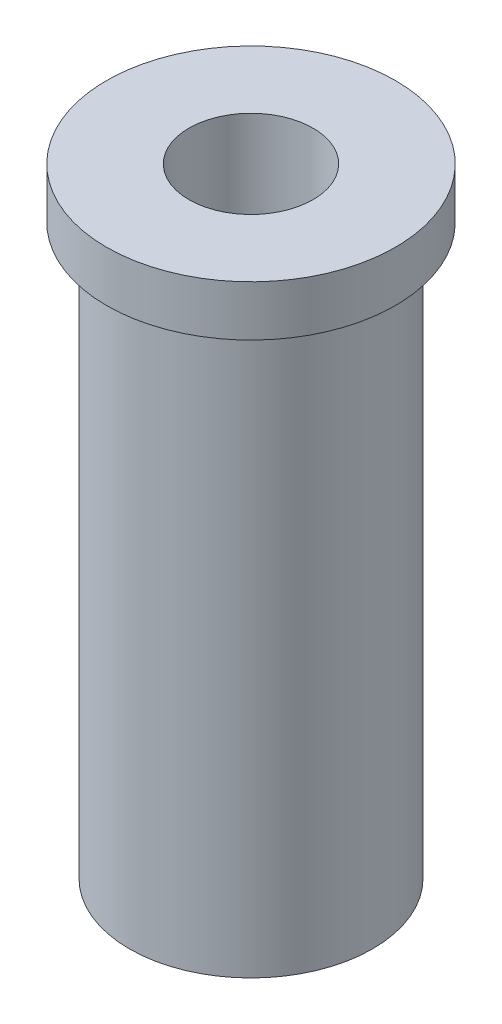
ISO-10303-21;
HEADER;
FILE_DESCRIPTION(('STEP AP214'),'2;1');
FILE_NAME('part.step','',(''),(''),'','','');
FILE_SCHEMA(('AUTOMOTIVE_DESIGN { 1 0 10303 214 1 1 1 1 }'));
ENDSEC;
DATA;
#1=APPLICATION_CONTEXT('core data for automotive mechanical design processes');
#2=APPLICATION_PROTOCOL_DEFINITION('international standard','automotive_design',2000,#1);
#3=PRODUCT_CONTEXT('',#1,'mechanical');
#4=PRODUCT('Part','Part','',(#3));
#5=PRODUCT_RELATED_PRODUCT_CATEGORY('part','',(#4));
#6=PRODUCT_DEFINITION_FORMATION('','',#4);
#7=PRODUCT_DEFINITION_CONTEXT('part definition',#1,'design');
#8=PRODUCT_DEFINITION('design','',#6,#7);
#9=PRODUCT_DEFINITION_SHAPE('','',#8);
#10=(LENGTH_UNIT() NAMED_UNIT(*) SI_UNIT(.MILLI.,.METRE.));
#11=(NAMED_UNIT(*) PLANE_ANGLE_UNIT() SI_UNIT($,.RADIAN.));
#12=(NAMED_UNIT(*) SI_UNIT($,.STERADIAN.) SOLID_ANGLE_UNIT());
#13=UNCERTAINTY_MEASURE_WITH_UNIT(LENGTH_MEASURE(1.E-05),#10,'distance_accuracy_value','');
#14=(GEOMETRIC_REPRESENTATION_CONTEXT(3) GLOBAL_UNCERTAINTY_ASSIGNED_CONTEXT((#13)) GLOBAL_UNIT_ASSIGNED_CONTEXT((#10,
#11,#12)) REPRESENTATION_CONTEXT('',''));
#15=CARTESIAN_POINT('',(0.,0.,0.));
#16=DIRECTION('',(0.,0.,1.));
#17=DIRECTION('',(1.,0.,0.));
#18=AXIS2_PLACEMENT_3D('',#15,#16,#17);
#19=CARTESIAN_POINT('',(0.,0.,0.));
#20=DIRECTION('',(0.,1.,0.));
#21=DIRECTION('',(0.,0.,1.));
#22=AXIS2_PLACEMENT_3D('',#19,#20,#21);
#23=CYLINDRICAL_SURFACE('',#22,4.75);
#24=CARTESIAN_POINT('',(0.,0.,0.));
#25=DIRECTION('',(0.,1.,0.));
#26=DIRECTION('',(0.,0.,1.));
#27=AXIS2_PLACEMENT_3D('',#24,#25,#26);
#28=CIRCLE('',#27,4.75);
#29=CARTESIAN_POINT('',(0.,0.,4.75));
#30=VERTEX_POINT('',#29);
#31=EDGE_CURVE('E54',#30,#30,#28,.T.);
#32=ORIENTED_EDGE('',*,*,#31,.F.);
#33=EDGE_LOOP('',(#32));
#34=FACE_BOUND('',#33,.T.);
#35=CARTESIAN_POINT('',(0.,-1.66,0.));
#36=DIRECTION('',(0.,1.,0.));
#37=DIRECTION('',(0.,0.,1.));
#38=AXIS2_PLACEMENT_3D('',#35,#36,#37);
#39=CIRCLE('',#38,4.75);
#40=CARTESIAN_POINT('',(0.,-1.66,4.75));
#41=VERTEX_POINT('',#40);
#42=EDGE_CURVE('E10',#41,#41,#39,.T.);
#43=ORIENTED_EDGE('',*,*,#42,.T.);
#44=EDGE_LOOP('',(#43));
#45=FACE_BOUND('',#44,.T.);
#46=ADVANCED_FACE('F32',(#34,#45),#23,.T.);
#47=CARTESIAN_POINT('',(4.75,-1.66,0.));
#48=DIRECTION('',(0.,1.,0.));
#49=DIRECTION('',(0.,0.,1.));
#50=AXIS2_PLACEMENT_3D('',#47,#48,#49);
#51=PLANE('',#50);
#52=ORIENTED_EDGE('',*,*,#42,.F.);
#53=EDGE_LOOP('',(#52));
#54=FACE_BOUND('',#53,.T.);
#55=CARTESIAN_POINT('',(0.,-1.66,0.));
#56=DIRECTION('',(0.,1.,0.));
#57=DIRECTION('',(0.,0.,1.));
#58=AXIS2_PLACEMENT_3D('',#55,#56,#57);
#59=CIRCLE('',#58,4.);
#60=CARTESIAN_POINT('',(0.,-1.66,4.));
#61=VERTEX_POINT('',#60);
#62=EDGE_CURVE('E38',#61,#61,#59,.T.);
#63=ORIENTED_EDGE('',*,*,#62,.T.);
#64=EDGE_LOOP('',(#63));
#65=FACE_BOUND('',#64,.T.);
#66=ADVANCED_FACE('F61',(#54,#65),#51,.F.);
#67=CARTESIAN_POINT('',(0.,0.,0.));
#68=DIRECTION('',(0.,1.,0.));
#69=DIRECTION('',(0.,0.,1.));
#70=AXIS2_PLACEMENT_3D('',#67,#68,#69);
#71=CYLINDRICAL_SURFACE('',#70,4.);
#72=ORIENTED_EDGE('',*,*,#62,.F.);
#73=EDGE_LOOP('',(#72));
#74=FACE_BOUND('',#73,.T.);
#75=CARTESIAN_POINT('',(0.,-20.36,0.));
#76=DIRECTION('',(0.,1.,0.));
#77=DIRECTION('',(0.,0.,1.));
#78=AXIS2_PLACEMENT_3D('',#75,#76,#77);
#79=CIRCLE('',#78,4.);
#80=CARTESIAN_POINT('',(0.,-20.36,4.));
#81=VERTEX_POINT('',#80);
#82=EDGE_CURVE('E42',#81,#81,#79,.T.);
#83=ORIENTED_EDGE('',*,*,#82,.T.);
#84=EDGE_LOOP('',(#83));
#85=FACE_BOUND('',#84,.T.);
#86=ADVANCED_FACE('F65',(#74,#85),#71,.T.);
#87=CARTESIAN_POINT('',(4.,-20.36,0.));
#88=DIRECTION('',(0.,1.,0.));
#89=DIRECTION('',(0.,0.,1.));
#90=AXIS2_PLACEMENT_3D('',#87,#88,#89);
#91=PLANE('',#90);
#92=ORIENTED_EDGE('',*,*,#82,.F.);
#93=EDGE_LOOP('',(#92));
#94=FACE_BOUND('',#93,.T.);
#95=CARTESIAN_POINT('',(0.,-20.36,0.));
#96=DIRECTION('',(0.,1.,0.));
#97=DIRECTION('',(0.,0.,1.));
#98=AXIS2_PLACEMENT_3D('',#95,#96,#97);
#99=CIRCLE('',#98,2.04000000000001);
#100=CARTESIAN_POINT('',(0.,-20.36,2.04000000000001));
#101=VERTEX_POINT('',#100);
#102=EDGE_CURVE('E46',#101,#101,#99,.T.);
#103=ORIENTED_EDGE('',*,*,#102,.T.);
#104=EDGE_LOOP('',(#103));
#105=FACE_BOUND('',#104,.T.);
#106=ADVANCED_FACE('F70',(#94,#105),#91,.F.);
#107=CARTESIAN_POINT('',(0.,0.,0.));
#108=DIRECTION('',(0.,1.,0.));
#109=DIRECTION('',(0.,0.,1.));
#110=AXIS2_PLACEMENT_3D('',#107,#108,#109);
#111=CYLINDRICAL_SURFACE('',#110,2.04000000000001);
#112=ORIENTED_EDGE('',*,*,#102,.F.);
#113=EDGE_LOOP('',(#112));
#114=FACE_BOUND('',#113,.T.);
#115=CARTESIAN_POINT('',(0.,0.,0.));
#116=DIRECTION('',(0.,1.,0.));
#117=DIRECTION('',(0.,0.,1.));
#118=AXIS2_PLACEMENT_3D('',#115,#116,#117);
#119=CIRCLE('',#118,2.04000000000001);
#120=CARTESIAN_POINT('',(0.,0.,2.04000000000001));
#121=VERTEX_POINT('',#120);
#122=EDGE_CURVE('E51',#121,#121,#119,.T.);
#123=ORIENTED_EDGE('',*,*,#122,.T.);
#124=EDGE_LOOP('',(#123));
#125=FACE_BOUND('',#124,.T.);
#126=ADVANCED_FACE('F76',(#114,#125),#111,.F.);
#127=CARTESIAN_POINT('',(2.04000000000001,0.,0.));
#128=DIRECTION('',(0.,-1.,0.));
#129=DIRECTION('',(0.,0.,-1.));
#130=AXIS2_PLACEMENT_3D('',#127,#128,#129);
#131=PLANE('',#130);
#132=ORIENTED_EDGE('',*,*,#122,.F.);
#133=EDGE_LOOP('',(#132));
#134=FACE_BOUND('',#133,.T.);
#135=ORIENTED_EDGE('',*,*,#31,.T.);
#136=EDGE_LOOP('',(#135));
#137=FACE_BOUND('',#136,.T.);
#138=ADVANCED_FACE('F58',(#134,#137),#131,.F.);
#139=CLOSED_SHELL('',(#46,#66,#86,#106,#126,#138));
#140=MANIFOLD_SOLID_BREP('B2',#139);
#141=ADVANCED_BREP_SHAPE_REPRESENTATION('',(#18,#140),#14);
#142=SHAPE_DEFINITION_REPRESENTATION(#9,#141);
ENDSEC;
END-ISO-10303-21;
